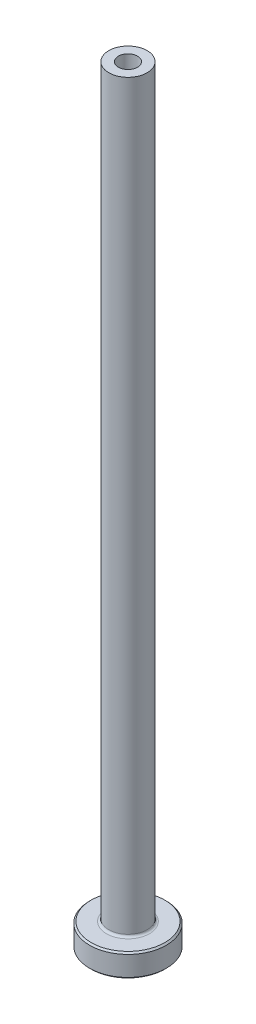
from build123d import *

# Parameters (mm, degrees)
FILLET1_R     = 0.3
CHAMFER1_SIZE = 0.2
CHAMFER3_SIZE = 0.5


with BuildPart() as part:
    # Sketch1 → Revolve1 (revolve)
    with BuildSketch(Plane.XY, mode=Mode.PRIVATE) as revolve1_sk:
        Polygon((-1.25, 100), (-2.5, 100), (-2.5, 3), (-5, 3), (-5, 0), (-1.5, 0), (-1.5, 53), (-1.25, 65), align=None)
    revolve(revolve1_sk.sketch.rotate(Axis((0, 92.187680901, 0), (0, -1, 0)), 270), axis=Axis((0, 92.187680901, 0), (0, -1, 0)))

    # Fillet1
    fillet1_edges = [part.edges().sort_by_distance(p)[0] for p in [
        (0, 3, -2.5),
    ]]
    fillet(fillet1_edges, radius=FILLET1_R)

    # Chamfer1
    chamfer1_edges = [part.edges().sort_by_distance(p)[0] for p in [
        (0, 0, -5),
        (0, 3, -5),
    ]]
    chamfer(chamfer1_edges, length=CHAMFER1_SIZE)

    # Chamfer3
    chamfer3_edges = [part.edges().sort_by_distance(p)[0] for p in [
        (0, 0, -1.5),
    ]]
    chamfer(chamfer3_edges, length=CHAMFER3_SIZE)


solid = part.part
